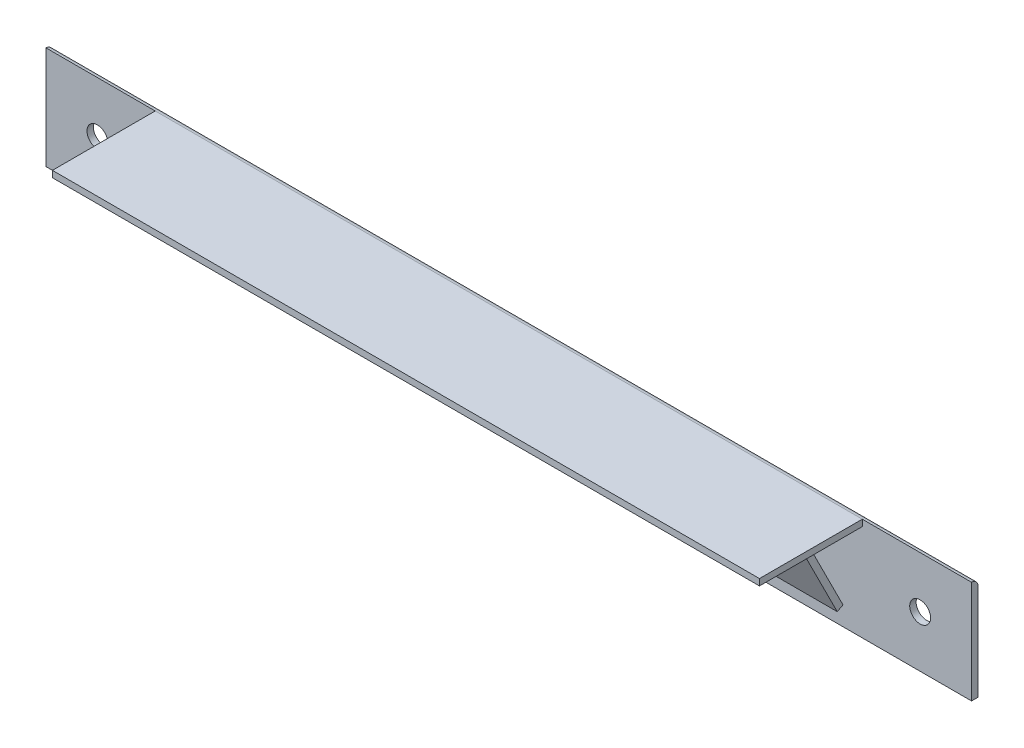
ISO-10303-21;
HEADER;
FILE_DESCRIPTION(('STEP AP214'),'2;1');
FILE_NAME('part.step','',(''),(''),'','','');
FILE_SCHEMA(('AUTOMOTIVE_DESIGN { 1 0 10303 214 1 1 1 1 }'));
ENDSEC;
DATA;
#1=APPLICATION_CONTEXT('core data for automotive mechanical design processes');
#2=APPLICATION_PROTOCOL_DEFINITION('international standard','automotive_design',2000,#1);
#3=PRODUCT_CONTEXT('',#1,'mechanical');
#4=PRODUCT('Part','Part','',(#3));
#5=PRODUCT_RELATED_PRODUCT_CATEGORY('part','',(#4));
#6=PRODUCT_DEFINITION_FORMATION('','',#4);
#7=PRODUCT_DEFINITION_CONTEXT('part definition',#1,'design');
#8=PRODUCT_DEFINITION('design','',#6,#7);
#9=PRODUCT_DEFINITION_SHAPE('','',#8);
#10=(LENGTH_UNIT() NAMED_UNIT(*) SI_UNIT(.MILLI.,.METRE.));
#11=(NAMED_UNIT(*) PLANE_ANGLE_UNIT() SI_UNIT($,.RADIAN.));
#12=(NAMED_UNIT(*) SI_UNIT($,.STERADIAN.) SOLID_ANGLE_UNIT());
#13=UNCERTAINTY_MEASURE_WITH_UNIT(LENGTH_MEASURE(1.E-05),#10,'distance_accuracy_value','');
#14=(GEOMETRIC_REPRESENTATION_CONTEXT(3) GLOBAL_UNCERTAINTY_ASSIGNED_CONTEXT((#13)) GLOBAL_UNIT_ASSIGNED_CONTEXT((#10,
#11,#12)) REPRESENTATION_CONTEXT('',''));
#15=CARTESIAN_POINT('',(0.,0.,0.));
#16=DIRECTION('',(0.,0.,1.));
#17=DIRECTION('',(1.,0.,0.));
#18=AXIS2_PLACEMENT_3D('',#15,#16,#17);
#19=CARTESIAN_POINT('',(-787.4,-9.22365967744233,50.509252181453));
#20=DIRECTION('',(0.,0.89369260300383,0.448679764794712));
#21=DIRECTION('',(0.,-0.448679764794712,0.89369260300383));
#22=AXIS2_PLACEMENT_3D('',#19,#20,#21);
#23=PLANE('',#22);
#24=DIRECTION('',(0.,-0.448679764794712,0.89369260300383));
#25=VECTOR('',#24,1.);
#26=CARTESIAN_POINT('',(-127.,-9.22365967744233,50.509252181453));
#27=LINE('',#26,#25);
#28=CARTESIAN_POINT('',(-127.,-6.35,44.785418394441));
#29=VERTEX_POINT('',#28);
#30=CARTESIAN_POINT('',(-127.,-9.22365967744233,50.509252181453));
#31=VERTEX_POINT('',#30);
#32=EDGE_CURVE('E56',#29,#31,#27,.T.);
#33=ORIENTED_EDGE('',*,*,#32,.F.);
#34=DIRECTION('',(1.,0.,0.));
#35=VECTOR('',#34,1.);
#36=CARTESIAN_POINT('',(-787.4,-6.35,44.785418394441));
#37=LINE('',#36,#35);
#38=CARTESIAN_POINT('',(-787.4,-6.35,44.785418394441));
#39=VERTEX_POINT('',#38);
#40=EDGE_CURVE('E12',#39,#29,#37,.T.);
#41=ORIENTED_EDGE('',*,*,#40,.F.);
#42=DIRECTION('',(0.,-0.448679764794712,0.89369260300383));
#43=VECTOR('',#42,1.);
#44=CARTESIAN_POINT('',(-787.4,-9.22365967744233,50.509252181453));
#45=LINE('',#44,#43);
#46=CARTESIAN_POINT('',(-787.4,-9.22365967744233,50.509252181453));
#47=VERTEX_POINT('',#46);
#48=EDGE_CURVE('E107',#39,#47,#45,.T.);
#49=ORIENTED_EDGE('',*,*,#48,.T.);
#50=DIRECTION('',(1.,0.,0.));
#51=VECTOR('',#50,1.);
#52=CARTESIAN_POINT('',(-787.4,-9.22365967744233,50.509252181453));
#53=LINE('',#52,#51);
#54=EDGE_CURVE('E43',#47,#31,#53,.T.);
#55=ORIENTED_EDGE('',*,*,#54,.T.);
#56=EDGE_LOOP('',(#33,#41,#49,#55));
#57=FACE_BOUND('',#56,.T.);
#58=ADVANCED_FACE('F40',(#57),#23,.T.);
#59=CARTESIAN_POINT('',(-787.4,-6.35,44.785418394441));
#60=DIRECTION('',(0.,0.448679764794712,-0.89369260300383));
#61=DIRECTION('',(0.,0.89369260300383,0.448679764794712));
#62=AXIS2_PLACEMENT_3D('',#59,#60,#61);
#63=PLANE('',#62);
#64=DIRECTION('',(0.,0.89369260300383,0.448679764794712));
#65=VECTOR('',#64,1.);
#66=CARTESIAN_POINT('',(-127.,-6.35,44.785418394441));
#67=LINE('',#66,#65);
#68=CARTESIAN_POINT('',(-127.,-82.9067155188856,6.35));
#69=VERTEX_POINT('',#68);
#70=EDGE_CURVE('E93',#69,#29,#67,.T.);
#71=ORIENTED_EDGE('',*,*,#70,.F.);
#72=DIRECTION('',(1.,0.,0.));
#73=VECTOR('',#72,1.);
#74=CARTESIAN_POINT('',(-787.4,-82.9067155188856,6.35));
#75=LINE('',#74,#73);
#76=CARTESIAN_POINT('',(-787.4,-82.9067155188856,6.35));
#77=VERTEX_POINT('',#76);
#78=EDGE_CURVE('E48',#77,#69,#75,.T.);
#79=ORIENTED_EDGE('',*,*,#78,.F.);
#80=DIRECTION('',(0.,0.89369260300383,0.448679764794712));
#81=VECTOR('',#80,1.);
#82=CARTESIAN_POINT('',(-787.4,-6.35,44.785418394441));
#83=LINE('',#82,#81);
#84=EDGE_CURVE('E100',#77,#39,#83,.T.);
#85=ORIENTED_EDGE('',*,*,#84,.T.);
#86=ORIENTED_EDGE('',*,*,#40,.T.);
#87=EDGE_LOOP('',(#71,#79,#85,#86));
#88=FACE_BOUND('',#87,.T.);
#89=ADVANCED_FACE('F111',(#88),#63,.T.);
#90=CARTESIAN_POINT('',(-787.4,-82.9067155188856,6.35));
#91=DIRECTION('',(0.,-0.893692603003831,-0.448679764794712));
#92=DIRECTION('',(0.,0.448679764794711,-0.893692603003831));
#93=AXIS2_PLACEMENT_3D('',#90,#91,#92);
#94=PLANE('',#93);
#95=DIRECTION('',(0.,0.448679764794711,-0.89369260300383));
#96=VECTOR('',#95,1.);
#97=CARTESIAN_POINT('',(-127.,-82.9067155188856,6.35));
#98=LINE('',#97,#96);
#99=CARTESIAN_POINT('',(-127.,-85.780375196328,12.0738337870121));
#100=VERTEX_POINT('',#99);
#101=EDGE_CURVE('E81',#100,#69,#98,.T.);
#102=ORIENTED_EDGE('',*,*,#101,.F.);
#103=DIRECTION('',(1.,0.,0.));
#104=VECTOR('',#103,1.);
#105=CARTESIAN_POINT('',(-787.4,-85.780375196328,12.0738337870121));
#106=LINE('',#105,#104);
#107=CARTESIAN_POINT('',(-787.4,-85.780375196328,12.0738337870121));
#108=VERTEX_POINT('',#107);
#109=EDGE_CURVE('E91',#108,#100,#106,.T.);
#110=ORIENTED_EDGE('',*,*,#109,.F.);
#111=DIRECTION('',(0.,0.448679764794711,-0.89369260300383));
#112=VECTOR('',#111,1.);
#113=CARTESIAN_POINT('',(-787.4,-82.9067155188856,6.35));
#114=LINE('',#113,#112);
#115=EDGE_CURVE('E104',#108,#77,#114,.T.);
#116=ORIENTED_EDGE('',*,*,#115,.T.);
#117=ORIENTED_EDGE('',*,*,#78,.T.);
#118=EDGE_LOOP('',(#102,#110,#116,#117));
#119=FACE_BOUND('',#118,.T.);
#120=ADVANCED_FACE('F89',(#119),#94,.T.);
#121=CARTESIAN_POINT('',(-787.4,-85.780375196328,12.0738337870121));
#122=DIRECTION('',(0.,-0.448679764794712,0.89369260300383));
#123=DIRECTION('',(0.,-0.893692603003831,-0.448679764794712));
#124=AXIS2_PLACEMENT_3D('',#121,#122,#123);
#125=PLANE('',#124);
#126=DIRECTION('',(0.,-0.89369260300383,-0.448679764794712));
#127=VECTOR('',#126,1.);
#128=CARTESIAN_POINT('',(-127.,-85.780375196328,12.0738337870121));
#129=LINE('',#128,#127);
#130=EDGE_CURVE('E78',#31,#100,#129,.T.);
#131=ORIENTED_EDGE('',*,*,#130,.F.);
#132=ORIENTED_EDGE('',*,*,#54,.F.);
#133=DIRECTION('',(0.,-0.89369260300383,-0.448679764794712));
#134=VECTOR('',#133,1.);
#135=CARTESIAN_POINT('',(-787.4,-85.780375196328,12.0738337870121));
#136=LINE('',#135,#134);
#137=EDGE_CURVE('E98',#47,#108,#136,.T.);
#138=ORIENTED_EDGE('',*,*,#137,.T.);
#139=ORIENTED_EDGE('',*,*,#109,.T.);
#140=EDGE_LOOP('',(#131,#132,#138,#139));
#141=FACE_BOUND('',#140,.T.);
#142=ADVANCED_FACE('F96',(#141),#125,.T.);
#143=CARTESIAN_POINT('',(-787.4,-6.35,44.785418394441));
#144=DIRECTION('',(-1.,0.,0.));
#145=DIRECTION('',(0.,0.,1.));
#146=AXIS2_PLACEMENT_3D('',#143,#144,#145);
#147=PLANE('',#146);
#148=ORIENTED_EDGE('',*,*,#48,.F.);
#149=ORIENTED_EDGE('',*,*,#84,.F.);
#150=ORIENTED_EDGE('',*,*,#115,.F.);
#151=ORIENTED_EDGE('',*,*,#137,.F.);
#152=EDGE_LOOP('',(#148,#149,#150,#151));
#153=FACE_BOUND('',#152,.T.);
#154=ADVANCED_FACE('F114',(#153),#147,.T.);
#155=CARTESIAN_POINT('',(-127.,-6.35,44.785418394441));
#156=DIRECTION('',(-1.,0.,0.));
#157=DIRECTION('',(0.,0.,1.));
#158=AXIS2_PLACEMENT_3D('',#155,#156,#157);
#159=PLANE('',#158);
#160=ORIENTED_EDGE('',*,*,#32,.T.);
#161=ORIENTED_EDGE('',*,*,#130,.T.);
#162=ORIENTED_EDGE('',*,*,#101,.T.);
#163=ORIENTED_EDGE('',*,*,#70,.T.);
#164=EDGE_LOOP('',(#160,#161,#162,#163));
#165=FACE_BOUND('',#164,.T.);
#166=ADVANCED_FACE('F80',(#165),#159,.F.);
#167=CLOSED_SHELL('',(#58,#89,#120,#142,#154,#166));
#168=MANIFOLD_SOLID_BREP('B2',#167);
#169=CARTESIAN_POINT('',(0.,-101.6,6.35));
#170=DIRECTION('',(0.,0.,-1.));
#171=DIRECTION('',(-1.,0.,0.));
#172=AXIS2_PLACEMENT_3D('',#169,#170,#171);
#173=PLANE('',#172);
#174=CARTESIAN_POINT('',(-863.6,-50.8,6.35));
#175=DIRECTION('',(0.,0.,1.));
#176=DIRECTION('',(1.,0.,0.));
#177=AXIS2_PLACEMENT_3D('',#174,#175,#176);
#178=CIRCLE('',#177,10.31875);
#179=CARTESIAN_POINT('',(-853.28125,-50.8,6.35));
#180=VERTEX_POINT('',#179);
#181=EDGE_CURVE('E281',#180,#180,#178,.T.);
#182=ORIENTED_EDGE('',*,*,#181,.F.);
#183=EDGE_LOOP('',(#182));
#184=FACE_BOUND('',#183,.T.);
#185=CARTESIAN_POINT('',(-50.8,-50.8,6.35));
#186=DIRECTION('',(0.,0.,1.));
#187=DIRECTION('',(1.,0.,0.));
#188=AXIS2_PLACEMENT_3D('',#185,#186,#187);
#189=CIRCLE('',#188,10.31875);
#190=CARTESIAN_POINT('',(-40.48125,-50.8,6.35));
#191=VERTEX_POINT('',#190);
#192=EDGE_CURVE('E253',#191,#191,#189,.T.);
#193=ORIENTED_EDGE('',*,*,#192,.F.);
#194=EDGE_LOOP('',(#193));
#195=FACE_BOUND('',#194,.T.);
#196=DIRECTION('',(0.,1.,0.));
#197=VECTOR('',#196,1.);
#198=CARTESIAN_POINT('',(-107.95,0.,6.35));
#199=LINE('',#198,#197);
#200=CARTESIAN_POINT('',(-107.95,-6.35,6.35));
#201=VERTEX_POINT('',#200);
#202=CARTESIAN_POINT('',(-107.95,0.,6.35));
#203=VERTEX_POINT('',#202);
#204=EDGE_CURVE('E252',#201,#203,#199,.T.);
#205=ORIENTED_EDGE('',*,*,#204,.F.);
#206=DIRECTION('',(1.,0.,0.));
#207=VECTOR('',#206,1.);
#208=CARTESIAN_POINT('',(-107.95,-6.35,6.35));
#209=LINE('',#208,#207);
#210=CARTESIAN_POINT('',(-806.45,-6.35,6.35));
#211=VERTEX_POINT('',#210);
#212=EDGE_CURVE('E248',#211,#201,#209,.T.);
#213=ORIENTED_EDGE('',*,*,#212,.F.);
#214=DIRECTION('',(0.,-1.,0.));
#215=VECTOR('',#214,1.);
#216=CARTESIAN_POINT('',(-806.45,0.,6.35));
#217=LINE('',#216,#215);
#218=CARTESIAN_POINT('',(-806.45,0.,6.35));
#219=VERTEX_POINT('',#218);
#220=EDGE_CURVE('E267',#219,#211,#217,.T.);
#221=ORIENTED_EDGE('',*,*,#220,.F.);
#222=DIRECTION('',(-1.,0.,0.));
#223=VECTOR('',#222,1.);
#224=CARTESIAN_POINT('',(0.,0.,6.35));
#225=LINE('',#224,#223);
#226=CARTESIAN_POINT('',(-914.4,-1.11978004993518E-13,6.35));
#227=VERTEX_POINT('',#226);
#228=EDGE_CURVE('E291',#219,#227,#225,.T.);
#229=ORIENTED_EDGE('',*,*,#228,.T.);
#230=DIRECTION('',(0.,-1.,0.));
#231=VECTOR('',#230,1.);
#232=CARTESIAN_POINT('',(-914.4,-1.11978004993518E-13,6.35));
#233=LINE('',#232,#231);
#234=CARTESIAN_POINT('',(-914.4,-101.6,6.35));
#235=VERTEX_POINT('',#234);
#236=EDGE_CURVE('E295',#227,#235,#233,.T.);
#237=ORIENTED_EDGE('',*,*,#236,.T.);
#238=DIRECTION('',(1.,0.,0.));
#239=VECTOR('',#238,1.);
#240=CARTESIAN_POINT('',(0.,-101.6,6.35));
#241=LINE('',#240,#239);
#242=CARTESIAN_POINT('',(0.,-101.6,6.35));
#243=VERTEX_POINT('',#242);
#244=EDGE_CURVE('E310',#235,#243,#241,.T.);
#245=ORIENTED_EDGE('',*,*,#244,.T.);
#246=DIRECTION('',(0.,1.,0.));
#247=VECTOR('',#246,1.);
#248=CARTESIAN_POINT('',(0.,0.,6.35));
#249=LINE('',#248,#247);
#250=CARTESIAN_POINT('',(0.,0.,6.35));
#251=VERTEX_POINT('',#250);
#252=EDGE_CURVE('E289',#243,#251,#249,.T.);
#253=ORIENTED_EDGE('',*,*,#252,.T.);
#254=EDGE_CURVE('E301',#251,#203,#225,.T.);
#255=ORIENTED_EDGE('',*,*,#254,.T.);
#256=EDGE_LOOP('',(#205,#213,#221,#229,#237,#245,#253,#255));
#257=FACE_BOUND('',#256,.T.);
#258=ADVANCED_FACE('F163',(#184,#195,#257),#173,.F.);
#259=CARTESIAN_POINT('',(0.,0.,6.35));
#260=DIRECTION('',(-1.,0.,0.));
#261=DIRECTION('',(0.,0.,1.));
#262=AXIS2_PLACEMENT_3D('',#259,#260,#261);
#263=PLANE('',#262);
#264=DIRECTION('',(0.,1.,0.));
#265=VECTOR('',#264,1.);
#266=CARTESIAN_POINT('',(0.,0.,0.));
#267=LINE('',#266,#265);
#268=CARTESIAN_POINT('',(0.,-101.6,0.));
#269=VERTEX_POINT('',#268);
#270=CARTESIAN_POINT('',(0.,-6.35,0.));
#271=VERTEX_POINT('',#270);
#272=EDGE_CURVE('E286',#269,#271,#267,.T.);
#273=ORIENTED_EDGE('',*,*,#272,.T.);
#274=CARTESIAN_POINT('',(0.,-6.35,6.35));
#275=DIRECTION('',(-1.,0.,0.));
#276=DIRECTION('',(0.,0.,1.));
#277=AXIS2_PLACEMENT_3D('',#274,#275,#276);
#278=CIRCLE('',#277,6.35);
#279=EDGE_CURVE('E38',#271,#251,#278,.F.);
#280=ORIENTED_EDGE('',*,*,#279,.T.);
#281=ORIENTED_EDGE('',*,*,#252,.F.);
#282=DIRECTION('',(0.,0.,-1.));
#283=VECTOR('',#282,1.);
#284=CARTESIAN_POINT('',(0.,-101.6,6.35));
#285=LINE('',#284,#283);
#286=EDGE_CURVE('E307',#243,#269,#285,.T.);
#287=ORIENTED_EDGE('',*,*,#286,.T.);
#288=EDGE_LOOP('',(#273,#280,#281,#287));
#289=FACE_BOUND('',#288,.T.);
#290=ADVANCED_FACE('F326',(#289),#263,.F.);
#291=CARTESIAN_POINT('',(0.,0.,6.35));
#292=DIRECTION('',(0.,-1.,0.));
#293=DIRECTION('',(1.,0.,0.));
#294=AXIS2_PLACEMENT_3D('',#291,#292,#293);
#295=PLANE('',#294);
#296=DIRECTION('',(0.,0.,-1.));
#297=VECTOR('',#296,1.);
#298=CARTESIAN_POINT('',(-107.95,0.,107.95));
#299=LINE('',#298,#297);
#300=CARTESIAN_POINT('',(-107.95,0.,107.95));
#301=VERTEX_POINT('',#300);
#302=EDGE_CURVE('E233',#301,#203,#299,.T.);
#303=ORIENTED_EDGE('',*,*,#302,.T.);
#304=DIRECTION('',(-1.,0.,0.));
#305=VECTOR('',#304,1.);
#306=CARTESIAN_POINT('',(-914.4,-1.11978004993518E-13,6.35));
#307=LINE('',#306,#305);
#308=EDGE_CURVE('E268',#203,#219,#307,.T.);
#309=ORIENTED_EDGE('',*,*,#308,.T.);
#310=DIRECTION('',(0.,0.,-1.));
#311=VECTOR('',#310,1.);
#312=CARTESIAN_POINT('',(-806.45,0.,107.95));
#313=LINE('',#312,#311);
#314=CARTESIAN_POINT('',(-806.45,0.,107.95));
#315=VERTEX_POINT('',#314);
#316=EDGE_CURVE('E236',#315,#219,#313,.T.);
#317=ORIENTED_EDGE('',*,*,#316,.F.);
#318=DIRECTION('',(-1.,0.,0.));
#319=VECTOR('',#318,1.);
#320=CARTESIAN_POINT('',(-107.95,0.,107.95));
#321=LINE('',#320,#319);
#322=EDGE_CURVE('E229',#301,#315,#321,.T.);
#323=ORIENTED_EDGE('',*,*,#322,.F.);
#324=EDGE_LOOP('',(#303,#309,#317,#323));
#325=FACE_BOUND('',#324,.T.);
#326=ADVANCED_FACE('F231',(#325),#295,.F.);
#327=CARTESIAN_POINT('',(-914.4,-1.11978004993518E-13,6.35));
#328=DIRECTION('',(1.,0.,0.));
#329=DIRECTION('',(0.,0.,-1.));
#330=AXIS2_PLACEMENT_3D('',#327,#328,#329);
#331=PLANE('',#330);
#332=ORIENTED_EDGE('',*,*,#236,.F.);
#333=CARTESIAN_POINT('',(-914.4,-6.35000000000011,6.35));
#334=DIRECTION('',(1.,0.,0.));
#335=DIRECTION('',(0.,0.,-1.));
#336=AXIS2_PLACEMENT_3D('',#333,#334,#335);
#337=CIRCLE('',#336,6.35);
#338=CARTESIAN_POINT('',(-914.4,-6.35000000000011,0.));
#339=VERTEX_POINT('',#338);
#340=EDGE_CURVE('E185',#227,#339,#337,.F.);
#341=ORIENTED_EDGE('',*,*,#340,.T.);
#342=DIRECTION('',(0.,-1.,0.));
#343=VECTOR('',#342,1.);
#344=CARTESIAN_POINT('',(-914.4,-1.11978004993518E-13,0.));
#345=LINE('',#344,#343);
#346=CARTESIAN_POINT('',(-914.4,-101.6,0.));
#347=VERTEX_POINT('',#346);
#348=EDGE_CURVE('E312',#339,#347,#345,.T.);
#349=ORIENTED_EDGE('',*,*,#348,.T.);
#350=DIRECTION('',(0.,0.,-1.));
#351=VECTOR('',#350,1.);
#352=CARTESIAN_POINT('',(-914.4,-101.6,6.35));
#353=LINE('',#352,#351);
#354=EDGE_CURVE('E304',#235,#347,#353,.T.);
#355=ORIENTED_EDGE('',*,*,#354,.F.);
#356=EDGE_LOOP('',(#332,#341,#349,#355));
#357=FACE_BOUND('',#356,.T.);
#358=ADVANCED_FACE('F320',(#357),#331,.F.);
#359=CARTESIAN_POINT('',(0.,-101.6,6.35));
#360=DIRECTION('',(0.,1.,0.));
#361=DIRECTION('',(-1.,0.,0.));
#362=AXIS2_PLACEMENT_3D('',#359,#360,#361);
#363=PLANE('',#362);
#364=DIRECTION('',(1.,0.,0.));
#365=VECTOR('',#364,1.);
#366=CARTESIAN_POINT('',(0.,-101.6,0.));
#367=LINE('',#366,#365);
#368=EDGE_CURVE('E292',#347,#269,#367,.T.);
#369=ORIENTED_EDGE('',*,*,#368,.T.);
#370=ORIENTED_EDGE('',*,*,#286,.F.);
#371=ORIENTED_EDGE('',*,*,#244,.F.);
#372=ORIENTED_EDGE('',*,*,#354,.T.);
#373=EDGE_LOOP('',(#369,#370,#371,#372));
#374=FACE_BOUND('',#373,.T.);
#375=ADVANCED_FACE('F323',(#374),#363,.F.);
#376=CARTESIAN_POINT('',(0.,-101.6,0.));
#377=DIRECTION('',(0.,0.,-1.));
#378=DIRECTION('',(-1.,0.,0.));
#379=AXIS2_PLACEMENT_3D('',#376,#377,#378);
#380=PLANE('',#379);
#381=CARTESIAN_POINT('',(-50.8,-50.8,0.));
#382=DIRECTION('',(0.,0.,1.));
#383=DIRECTION('',(1.,0.,0.));
#384=AXIS2_PLACEMENT_3D('',#381,#382,#383);
#385=CIRCLE('',#384,10.31875);
#386=CARTESIAN_POINT('',(-40.48125,-50.8,0.));
#387=VERTEX_POINT('',#386);
#388=EDGE_CURVE('E256',#387,#387,#385,.T.);
#389=ORIENTED_EDGE('',*,*,#388,.T.);
#390=EDGE_LOOP('',(#389));
#391=FACE_BOUND('',#390,.T.);
#392=CARTESIAN_POINT('',(-863.6,-50.8,0.));
#393=DIRECTION('',(0.,0.,1.));
#394=DIRECTION('',(1.,0.,0.));
#395=AXIS2_PLACEMENT_3D('',#392,#393,#394);
#396=CIRCLE('',#395,10.31875);
#397=CARTESIAN_POINT('',(-853.28125,-50.8,0.));
#398=VERTEX_POINT('',#397);
#399=EDGE_CURVE('E283',#398,#398,#396,.T.);
#400=ORIENTED_EDGE('',*,*,#399,.T.);
#401=EDGE_LOOP('',(#400));
#402=FACE_BOUND('',#401,.T.);
#403=ORIENTED_EDGE('',*,*,#348,.F.);
#404=DIRECTION('',(-1.,0.,0.));
#405=VECTOR('',#404,1.);
#406=CARTESIAN_POINT('',(0.,-6.35,0.));
#407=LINE('',#406,#405);
#408=EDGE_CURVE('E171',#339,#271,#407,.F.);
#409=ORIENTED_EDGE('',*,*,#408,.T.);
#410=ORIENTED_EDGE('',*,*,#272,.F.);
#411=ORIENTED_EDGE('',*,*,#368,.F.);
#412=EDGE_LOOP('',(#403,#409,#410,#411));
#413=FACE_BOUND('',#412,.T.);
#414=ADVANCED_FACE('F358',(#391,#402,#413),#380,.T.);
#415=CARTESIAN_POINT('',(-863.6,-50.8,0.));
#416=DIRECTION('',(0.,0.,1.));
#417=DIRECTION('',(1.,0.,0.));
#418=AXIS2_PLACEMENT_3D('',#415,#416,#417);
#419=CYLINDRICAL_SURFACE('',#418,10.31875);
#420=ORIENTED_EDGE('',*,*,#399,.F.);
#421=EDGE_LOOP('',(#420));
#422=FACE_BOUND('',#421,.T.);
#423=ORIENTED_EDGE('',*,*,#181,.T.);
#424=EDGE_LOOP('',(#423));
#425=FACE_BOUND('',#424,.T.);
#426=ADVANCED_FACE('F356',(#422,#425),#419,.F.);
#427=CARTESIAN_POINT('',(-50.8,-50.8,0.));
#428=DIRECTION('',(0.,0.,1.));
#429=DIRECTION('',(1.,0.,0.));
#430=AXIS2_PLACEMENT_3D('',#427,#428,#429);
#431=CYLINDRICAL_SURFACE('',#430,10.31875);
#432=ORIENTED_EDGE('',*,*,#388,.F.);
#433=EDGE_LOOP('',(#432));
#434=FACE_BOUND('',#433,.T.);
#435=ORIENTED_EDGE('',*,*,#192,.T.);
#436=EDGE_LOOP('',(#435));
#437=FACE_BOUND('',#436,.T.);
#438=ADVANCED_FACE('F391',(#434,#437),#431,.F.);
#439=CARTESIAN_POINT('',(-107.95,0.,107.95));
#440=DIRECTION('',(-1.,0.,0.));
#441=DIRECTION('',(0.,0.,1.));
#442=AXIS2_PLACEMENT_3D('',#439,#440,#441);
#443=PLANE('',#442);
#444=ORIENTED_EDGE('',*,*,#204,.T.);
#445=ORIENTED_EDGE('',*,*,#302,.F.);
#446=DIRECTION('',(0.,1.,0.));
#447=VECTOR('',#446,1.);
#448=CARTESIAN_POINT('',(-107.95,0.,107.95));
#449=LINE('',#448,#447);
#450=CARTESIAN_POINT('',(-107.95,-6.35,107.95));
#451=VERTEX_POINT('',#450);
#452=EDGE_CURVE('E240',#451,#301,#449,.T.);
#453=ORIENTED_EDGE('',*,*,#452,.F.);
#454=DIRECTION('',(0.,0.,-1.));
#455=VECTOR('',#454,1.);
#456=CARTESIAN_POINT('',(-107.95,-6.35,107.95));
#457=LINE('',#456,#455);
#458=EDGE_CURVE('E276',#451,#201,#457,.T.);
#459=ORIENTED_EDGE('',*,*,#458,.T.);
#460=EDGE_LOOP('',(#444,#445,#453,#459));
#461=FACE_BOUND('',#460,.T.);
#462=ADVANCED_FACE('F250',(#461),#443,.F.);
#463=CARTESIAN_POINT('',(-806.45,0.,107.95));
#464=DIRECTION('',(1.,0.,0.));
#465=DIRECTION('',(0.,0.,-1.));
#466=AXIS2_PLACEMENT_3D('',#463,#464,#465);
#467=PLANE('',#466);
#468=ORIENTED_EDGE('',*,*,#220,.T.);
#469=DIRECTION('',(0.,0.,-1.));
#470=VECTOR('',#469,1.);
#471=CARTESIAN_POINT('',(-806.45,-6.35,107.95));
#472=LINE('',#471,#470);
#473=CARTESIAN_POINT('',(-806.45,-6.35,107.95));
#474=VERTEX_POINT('',#473);
#475=EDGE_CURVE('E258',#474,#211,#472,.T.);
#476=ORIENTED_EDGE('',*,*,#475,.F.);
#477=DIRECTION('',(0.,-1.,0.));
#478=VECTOR('',#477,1.);
#479=CARTESIAN_POINT('',(-806.45,0.,107.95));
#480=LINE('',#479,#478);
#481=EDGE_CURVE('E239',#315,#474,#480,.T.);
#482=ORIENTED_EDGE('',*,*,#481,.F.);
#483=ORIENTED_EDGE('',*,*,#316,.T.);
#484=EDGE_LOOP('',(#468,#476,#482,#483));
#485=FACE_BOUND('',#484,.T.);
#486=ADVANCED_FACE('F335',(#485),#467,.F.);
#487=CARTESIAN_POINT('',(-107.95,-6.35,107.95));
#488=DIRECTION('',(0.,1.,0.));
#489=DIRECTION('',(0.,0.,1.));
#490=AXIS2_PLACEMENT_3D('',#487,#488,#489);
#491=PLANE('',#490);
#492=ORIENTED_EDGE('',*,*,#212,.T.);
#493=ORIENTED_EDGE('',*,*,#458,.F.);
#494=DIRECTION('',(1.,0.,0.));
#495=VECTOR('',#494,1.);
#496=CARTESIAN_POINT('',(-107.95,-6.35,107.95));
#497=LINE('',#496,#495);
#498=EDGE_CURVE('E245',#474,#451,#497,.T.);
#499=ORIENTED_EDGE('',*,*,#498,.F.);
#500=ORIENTED_EDGE('',*,*,#475,.T.);
#501=EDGE_LOOP('',(#492,#493,#499,#500));
#502=FACE_BOUND('',#501,.T.);
#503=ADVANCED_FACE('F337',(#502),#491,.F.);
#504=CARTESIAN_POINT('',(-107.95,-6.35,107.95));
#505=DIRECTION('',(0.,0.,-1.));
#506=DIRECTION('',(-1.,0.,0.));
#507=AXIS2_PLACEMENT_3D('',#504,#505,#506);
#508=PLANE('',#507);
#509=ORIENTED_EDGE('',*,*,#452,.T.);
#510=ORIENTED_EDGE('',*,*,#322,.T.);
#511=ORIENTED_EDGE('',*,*,#481,.T.);
#512=ORIENTED_EDGE('',*,*,#498,.T.);
#513=EDGE_LOOP('',(#509,#510,#511,#512));
#514=FACE_BOUND('',#513,.T.);
#515=ADVANCED_FACE('F243',(#514),#508,.F.);
#516=CARTESIAN_POINT('',(0.,-6.35,6.35));
#517=DIRECTION('',(1.,0.,0.));
#518=DIRECTION('',(0.,1.,0.));
#519=AXIS2_PLACEMENT_3D('',#516,#517,#518);
#520=CYLINDRICAL_SURFACE('',#519,6.35);
#521=ORIENTED_EDGE('',*,*,#279,.F.);
#522=ORIENTED_EDGE('',*,*,#408,.F.);
#523=ORIENTED_EDGE('',*,*,#340,.F.);
#524=ORIENTED_EDGE('',*,*,#228,.F.);
#525=ORIENTED_EDGE('',*,*,#308,.F.);
#526=ORIENTED_EDGE('',*,*,#254,.F.);
#527=EDGE_LOOP('',(#521,#522,#523,#524,#525,#526));
#528=FACE_BOUND('',#527,.T.);
#529=ADVANCED_FACE('F165',(#528),#520,.T.);
#530=CLOSED_SHELL('',(#258,#290,#326,#358,#375,#414,#426,#438,#462,#486,#503,#515,#529));
#531=MANIFOLD_SOLID_BREP('B6',#530);
#532=ADVANCED_BREP_SHAPE_REPRESENTATION('',(#18,#168,#531),#14);
#533=SHAPE_DEFINITION_REPRESENTATION(#9,#532);
ENDSEC;
END-ISO-10303-21;
